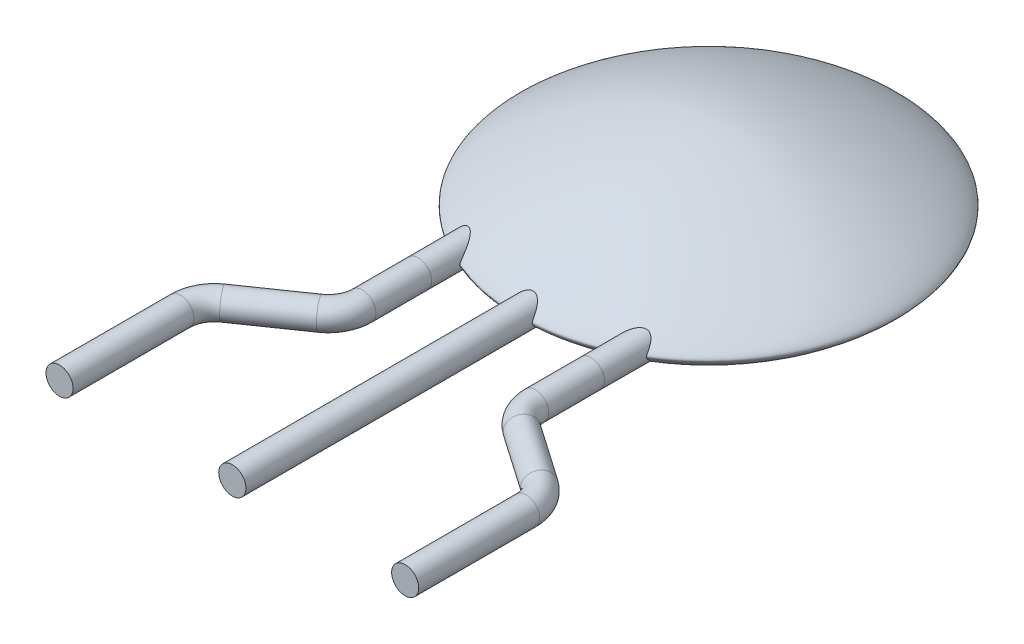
ISO-10303-21;
HEADER;
FILE_DESCRIPTION(('STEP AP214'),'2;1');
FILE_NAME('part.step','',(''),(''),'','','');
FILE_SCHEMA(('AUTOMOTIVE_DESIGN { 1 0 10303 214 1 1 1 1 }'));
ENDSEC;
DATA;
#1=APPLICATION_CONTEXT('core data for automotive mechanical design processes');
#2=APPLICATION_PROTOCOL_DEFINITION('international standard','automotive_design',2000,#1);
#3=PRODUCT_CONTEXT('',#1,'mechanical');
#4=PRODUCT('Part','Part','',(#3));
#5=PRODUCT_RELATED_PRODUCT_CATEGORY('part','',(#4));
#6=PRODUCT_DEFINITION_FORMATION('','',#4);
#7=PRODUCT_DEFINITION_CONTEXT('part definition',#1,'design');
#8=PRODUCT_DEFINITION('design','',#6,#7);
#9=PRODUCT_DEFINITION_SHAPE('','',#8);
#10=(LENGTH_UNIT() NAMED_UNIT(*) SI_UNIT(.MILLI.,.METRE.));
#11=(NAMED_UNIT(*) PLANE_ANGLE_UNIT() SI_UNIT($,.RADIAN.));
#12=(NAMED_UNIT(*) SI_UNIT($,.STERADIAN.) SOLID_ANGLE_UNIT());
#13=UNCERTAINTY_MEASURE_WITH_UNIT(LENGTH_MEASURE(1.E-05),#10,'distance_accuracy_value','');
#14=(GEOMETRIC_REPRESENTATION_CONTEXT(3) GLOBAL_UNCERTAINTY_ASSIGNED_CONTEXT((#13)) GLOBAL_UNIT_ASSIGNED_CONTEXT((#10,
#11,#12)) REPRESENTATION_CONTEXT('',''));
#15=CARTESIAN_POINT('',(0.,0.,0.));
#16=DIRECTION('',(0.,0.,1.));
#17=DIRECTION('',(1.,0.,0.));
#18=AXIS2_PLACEMENT_3D('',#15,#16,#17);
#19=CARTESIAN_POINT('',(0.,1.05,0.));
#20=CARTESIAN_POINT('',(-1.17248497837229,1.04999999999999,0.));
#21=CARTESIAN_POINT('',(-2.8,0.16193282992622,0.));
#22=CARTESIAN_POINT('',(-2.8,-0.16193282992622,0.));
#23=CARTESIAN_POINT('',(-1.2956675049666,-1.05,0.));
#24=CARTESIAN_POINT('',(0.,-1.05,0.));
#25=B_SPLINE_CURVE_WITH_KNOTS('',3,(#19,#20,#21,#22,#23,#24),.UNSPECIFIED.,.F.,.F.,(4,2,4),(0.,
0.5,1.),.UNSPECIFIED.);
#26=CARTESIAN_POINT('',(0.,1.05,0.));
#27=DIRECTION('',(0.,1.,0.));
#28=AXIS1_PLACEMENT('',#26,#27);
#29=SURFACE_OF_REVOLUTION('',#25,#28);
#30=CARTESIAN_POINT('',(0.,1.05,0.));
#31=VERTEX_POINT('',#30);
#32=VERTEX_LOOP('',#31);
#33=FACE_BOUND('',#32,.T.);
#34=CARTESIAN_POINT('',(0.,-1.05,0.));
#35=VERTEX_POINT('',#34);
#36=VERTEX_LOOP('',#35);
#37=FACE_BOUND('',#36,.T.);
#38=CARTESIAN_POINT('',(-1.07000000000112,0.,2.58748913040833));
#39=CARTESIAN_POINT('',(-1.07000007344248,0.0035103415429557,2.5874711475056));
#40=CARTESIAN_POINT('',(-1.0700971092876,0.00702169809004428,2.58662128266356));
#41=CARTESIAN_POINT('',(-1.07041537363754,0.0132211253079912,2.58427957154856));
#42=CARTESIAN_POINT('',(-1.07061950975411,0.0159572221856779,2.58288155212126));
#43=CARTESIAN_POINT('',(-1.07111315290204,0.0212332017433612,2.57975653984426));
#44=CARTESIAN_POINT('',(-1.07140274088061,0.0237728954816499,2.5780292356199));
#45=CARTESIAN_POINT('',(-1.07226853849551,0.0303236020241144,2.57315774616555));
#46=CARTESIAN_POINT('',(-1.07290725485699,0.0341892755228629,2.56983549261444));
#47=CARTESIAN_POINT('',(-1.07434210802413,0.0416192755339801,2.56289663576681));
#48=CARTESIAN_POINT('',(-1.07513856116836,0.0451829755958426,2.55927944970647));
#49=CARTESIAN_POINT('',(-1.07773991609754,0.0555649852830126,2.54812605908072));
#50=CARTESIAN_POINT('',(-1.07975131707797,0.0620379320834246,2.54031912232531));
#51=CARTESIAN_POINT('',(-1.08525949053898,0.0772174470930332,2.52073450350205));
#52=CARTESIAN_POINT('',(-1.08901458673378,0.0855886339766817,2.50877634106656));
#53=CARTESIAN_POINT('',(-1.09740659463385,0.101446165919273,2.48456948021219));
#54=CARTESIAN_POINT('',(-1.1020450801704,0.108930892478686,2.47232029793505));
#55=CARTESIAN_POINT('',(-1.11722017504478,0.130250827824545,2.4354907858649));
#56=CARTESIAN_POINT('',(-1.12903259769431,0.142993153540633,2.41077014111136));
#57=CARTESIAN_POINT('',(-1.15111463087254,0.161189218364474,2.3716400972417));
#58=CARTESIAN_POINT('',(-1.16019345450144,0.167548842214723,2.35696443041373));
#59=CARTESIAN_POINT('',(-1.1800307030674,0.178990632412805,2.32826965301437));
#60=CARTESIAN_POINT('',(-1.19078525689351,0.184075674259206,2.31424912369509));
#61=CARTESIAN_POINT('',(-1.20970824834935,0.190843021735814,2.29283846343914));
#62=CARTESIAN_POINT('',(-1.21719947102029,0.193073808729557,2.28503256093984));
#63=CARTESIAN_POINT('',(-1.23305361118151,0.196728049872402,2.27017658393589));
#64=CARTESIAN_POINT('',(-1.24141557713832,0.19815237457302,2.2631257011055));
#65=CARTESIAN_POINT('',(-1.26267378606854,0.200246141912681,2.24767217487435));
#66=CARTESIAN_POINT('',(-1.27607419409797,0.200411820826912,2.23979865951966));
#67=CARTESIAN_POINT('',(-1.29575451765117,0.198413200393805,2.23197621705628));
#68=CARTESIAN_POINT('',(-1.30141339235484,0.197603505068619,2.23011909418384));
#69=CARTESIAN_POINT('',(-1.31283467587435,0.195445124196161,2.22724673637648));
#70=CARTESIAN_POINT('',(-1.3185968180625,0.194097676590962,2.22622958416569));
#71=CARTESIAN_POINT('',(-1.33008757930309,0.190853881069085,2.22512623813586));
#72=CARTESIAN_POINT('',(-1.33581591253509,0.188954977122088,2.22504445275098));
#73=CARTESIAN_POINT('',(-1.34702183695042,0.184672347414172,2.22581464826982));
#74=CARTESIAN_POINT('',(-1.35249926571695,0.182288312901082,2.22666722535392));
#75=CARTESIAN_POINT('',(-1.37002044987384,0.1737242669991,2.23089411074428));
#76=CARTESIAN_POINT('',(-1.38120637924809,0.166681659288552,2.23611093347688));
#77=CARTESIAN_POINT('',(-1.39868029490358,0.15341313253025,2.24759147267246));
#78=CARTESIAN_POINT('',(-1.40550348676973,0.147367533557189,2.25334470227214));
#79=CARTESIAN_POINT('',(-1.41791099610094,0.134902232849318,2.26577636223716));
#80=CARTESIAN_POINT('',(-1.42349014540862,0.128481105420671,2.27245847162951));
#81=CARTESIAN_POINT('',(-1.43761563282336,0.110135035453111,2.29190207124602));
#82=CARTESIAN_POINT('',(-1.44496408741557,0.0979173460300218,2.30524975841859));
#83=CARTESIAN_POINT('',(-1.45393400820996,0.0788432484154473,2.32535242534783));
#84=CARTESIAN_POINT('',(-1.45658005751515,0.0723681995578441,2.3320593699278));
#85=CARTESIAN_POINT('',(-1.46122101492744,0.0590332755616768,2.3453124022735));
#86=CARTESIAN_POINT('',(-1.46321698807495,0.0521740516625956,2.35185873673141));
#87=CARTESIAN_POINT('',(-1.46549465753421,0.0422994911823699,2.36042809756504));
#88=CARTESIAN_POINT('',(-1.4660657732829,0.0395751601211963,2.36271014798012));
#89=CARTESIAN_POINT('',(-1.4671106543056,0.0339931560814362,2.36714635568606));
#90=CARTESIAN_POINT('',(-1.46758417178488,0.0311351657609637,2.36930017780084));
#91=CARTESIAN_POINT('',(-1.46842632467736,0.025218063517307,2.37340341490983));
#92=CARTESIAN_POINT('',(-1.46879397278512,0.0221573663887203,2.37535080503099));
#93=CARTESIAN_POINT('',(-1.46939989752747,0.0158115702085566,2.3788471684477));
#94=CARTESIAN_POINT('',(-1.46963868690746,0.012527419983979,2.38039770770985));
#95=CARTESIAN_POINT('',(-1.469931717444,0.00601419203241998,2.38247631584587));
#96=CARTESIAN_POINT('',(-1.47000501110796,0.00282782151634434,2.38310651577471));
#97=CARTESIAN_POINT('',(-1.46999436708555,-0.00353345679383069,2.38306083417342));
#98=CARTESIAN_POINT('',(-1.46991006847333,-0.00670832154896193,2.38238195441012));
#99=CARTESIAN_POINT('',(-1.46956313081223,-0.0138448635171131,2.38012817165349));
#100=CARTESIAN_POINT('',(-1.46925001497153,-0.0177116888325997,2.37832858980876));
#101=CARTESIAN_POINT('',(-1.46844336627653,-0.0251832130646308,2.37425653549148));
#102=CARTESIAN_POINT('',(-1.4679489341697,-0.0287864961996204,2.37198173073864));
#103=CARTESIAN_POINT('',(-1.46639794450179,-0.0382737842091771,2.36549642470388));
#104=CARTESIAN_POINT('',(-1.46519107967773,-0.0439696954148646,2.36105420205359));
#105=CARTESIAN_POINT('',(-1.46236424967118,-0.0550296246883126,2.35189177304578));
#106=CARTESIAN_POINT('',(-1.46074350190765,-0.0603929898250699,2.34717105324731));
#107=CARTESIAN_POINT('',(-1.45526780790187,-0.0761632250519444,2.33284257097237));
#108=CARTESIAN_POINT('',(-1.45080312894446,-0.0862293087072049,2.32308526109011));
#109=CARTESIAN_POINT('',(-1.44008619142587,-0.105803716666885,2.30396115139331));
#110=CARTESIAN_POINT('',(-1.43383178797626,-0.115311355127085,2.29459483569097));
#111=CARTESIAN_POINT('',(-1.4192140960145,-0.133691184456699,2.27704162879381));
#112=CARTESIAN_POINT('',(-1.410864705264,-0.142567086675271,2.2688475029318));
#113=CARTESIAN_POINT('',(-1.39194139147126,-0.158985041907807,2.25512818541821));
#114=CARTESIAN_POINT('',(-1.38149964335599,-0.166571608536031,2.24948998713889));
#115=CARTESIAN_POINT('',(-1.36404222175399,-0.176641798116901,2.24386275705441));
#116=CARTESIAN_POINT('',(-1.35787575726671,-0.179797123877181,2.24245903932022));
#117=CARTESIAN_POINT('',(-1.34511579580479,-0.185488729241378,2.24081779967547));
#118=CARTESIAN_POINT('',(-1.33852288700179,-0.188025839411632,2.24057870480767));
#119=CARTESIAN_POINT('',(-1.32599435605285,-0.192100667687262,2.24127714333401));
#120=CARTESIAN_POINT('',(-1.32007765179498,-0.19372293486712,2.24207354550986));
#121=CARTESIAN_POINT('',(-1.30828988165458,-0.196393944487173,2.24453539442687));
#122=CARTESIAN_POINT('',(-1.30241892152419,-0.197441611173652,2.24620245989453));
#123=CARTESIAN_POINT('',(-1.28173036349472,-0.200220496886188,2.25350546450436));
#124=CARTESIAN_POINT('',(-1.26744793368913,-0.200412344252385,2.26124858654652));
#125=CARTESIAN_POINT('',(-1.24367210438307,-0.19855059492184,2.27745974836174));
#126=CARTESIAN_POINT('',(-1.23378903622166,-0.196930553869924,2.28548682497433));
#127=CARTESIAN_POINT('',(-1.21515593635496,-0.192567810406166,2.30252755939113));
#128=CARTESIAN_POINT('',(-1.20640842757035,-0.189822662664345,2.31154333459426));
#129=CARTESIAN_POINT('',(-1.18312391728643,-0.180872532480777,2.33781449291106));
#130=CARTESIAN_POINT('',(-1.16974665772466,-0.173679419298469,2.35574476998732));
#131=CARTESIAN_POINT('',(-1.14553449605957,-0.157230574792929,2.39241632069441));
#132=CARTESIAN_POINT('',(-1.13471256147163,-0.147964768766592,2.41116118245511));
#133=CARTESIAN_POINT('',(-1.11441541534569,-0.126617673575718,2.45059864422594));
#134=CARTESIAN_POINT('',(-1.10516153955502,-0.114353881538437,2.47130911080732));
#135=CARTESIAN_POINT('',(-1.09332884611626,-0.0940585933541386,2.50176087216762));
#136=CARTESIAN_POINT('',(-1.08973506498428,-0.0870050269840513,2.51177494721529));
#137=CARTESIAN_POINT('',(-1.08326526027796,-0.0720900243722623,2.53142049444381));
#138=CARTESIAN_POINT('',(-1.08038778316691,-0.0642302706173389,2.54105270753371));
#139=CARTESIAN_POINT('',(-1.0769994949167,-0.0525524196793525,2.5537225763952));
#140=CARTESIAN_POINT('',(-1.07612835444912,-0.0492540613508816,2.55714222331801));
#141=CARTESIAN_POINT('',(-1.07451779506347,-0.0424169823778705,2.56380074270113));
#142=CARTESIAN_POINT('',(-1.07377897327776,-0.038877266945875,2.56703875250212));
#143=CARTESIAN_POINT('',(-1.07245180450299,-0.0314491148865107,2.57323383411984));
#144=CARTESIAN_POINT('',(-1.07186542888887,-0.0275569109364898,2.57618694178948));
#145=CARTESIAN_POINT('',(-1.07089676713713,-0.0193698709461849,2.58148352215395));
#146=CARTESIAN_POINT('',(-1.07051327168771,-0.0150776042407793,2.58383056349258));
#147=CARTESIAN_POINT('',(-1.07009863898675,-0.00708540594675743,2.58667789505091));
#148=CARTESIAN_POINT('',(-1.06999992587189,-0.00354322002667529,2.58750728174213));
#149=CARTESIAN_POINT('',(-1.07000000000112,0.,2.58748913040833));
#150=B_SPLINE_CURVE_WITH_KNOTS('',3,(#38,#39,#40,#41,#42,#43,#44,#45,#46,#47,#48,#49,#50,#51,
#52,#53,#54,#55,#56,#57,#58,#59,#60,#61,#62,#63,#64,#65,#66,#67,#68,#69,#70,#71,#72,#73,#74,#75,
#76,#77,#78,#79,#80,#81,#82,#83,#84,#85,#86,#87,#88,#89,#90,#91,#92,#93,#94,#95,#96,#97,#98,#99,
#100,#101,#102,#103,#104,#105,#106,#107,#108,#109,#110,#111,#112,#113,#114,#115,#116,#117,#118,
#119,#120,#121,#122,#123,#124,#125,#126,#127,#128,#129,#130,#131,#132,#133,#134,#135,#136,#137,
#138,#139,#140,#141,#142,#143,#144,#145,#146,#147,#148,#149),.UNSPECIFIED.,.T.,.F.,(4,2,2,2,2,2,
2,2,2,2,2,2,2,2,2,2,2,2,2,2,2,2,2,2,2,2,2,2,2,2,2,2,2,2,2,2,2,2,2,2,2,2,2,2,2,2,2,2,2,2,2,2,2,2,
2,4),(0.,0.010546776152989,0.019771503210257,0.0290049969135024,0.0443819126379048,
0.0597899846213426,0.0907492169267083,0.135892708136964,0.181117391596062,0.271348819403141,
0.326439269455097,0.381404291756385,0.414466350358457,0.447492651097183,0.493269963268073,
0.511231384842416,0.529151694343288,0.54715642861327,0.565172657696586,0.606928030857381,
0.639155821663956,0.671515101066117,0.729767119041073,0.758828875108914,0.787842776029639,
0.798637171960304,0.809458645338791,0.820377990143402,0.831253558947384,0.840794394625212,
0.850357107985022,0.863138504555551,0.875984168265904,0.897909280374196,0.919876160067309,
0.963890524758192,1.00795786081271,1.05174025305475,1.09333245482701,1.11441723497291,
1.13547352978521,1.15393946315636,1.17243985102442,1.22019892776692,1.25857921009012,
1.29704335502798,1.36716149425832,1.43762816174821,1.51470036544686,1.55296795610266,
1.59115724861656,1.60564057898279,1.62018770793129,1.63491452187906,1.64955253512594,
1.66019809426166),.UNSPECIFIED.);
#151=CARTESIAN_POINT('',(-1.07000000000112,0.,2.58748913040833));
#152=VERTEX_POINT('',#151);
#153=EDGE_CURVE('E46',#152,#152,#150,.T.);
#154=ORIENTED_EDGE('',*,*,#153,.F.);
#155=EDGE_LOOP('',(#154));
#156=FACE_BOUND('',#155,.T.);
#157=CARTESIAN_POINT('',(1.47000000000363,0.,2.38308623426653));
#158=CARTESIAN_POINT('',(1.46999967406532,0.00371449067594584,2.3830677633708));
#159=CARTESIAN_POINT('',(1.46989144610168,0.007420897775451,2.38215189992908));
#160=CARTESIAN_POINT('',(1.46947322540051,0.0151314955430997,2.3792964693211));
#161=CARTESIAN_POINT('',(1.4691278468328,0.0190516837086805,2.37719144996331));
#162=CARTESIAN_POINT('',(1.46825798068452,0.0266046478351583,2.37252553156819));
#163=CARTESIAN_POINT('',(1.46773279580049,0.0302362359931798,2.36996287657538));
#164=CARTESIAN_POINT('',(1.46605837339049,0.0400254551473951,2.36251611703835));
#165=CARTESIAN_POINT('',(1.46474134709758,0.0459528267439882,2.35737566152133));
#166=CARTESIAN_POINT('',(1.46166454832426,0.0574419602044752,2.34682128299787));
#167=CARTESIAN_POINT('',(1.45990392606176,0.0630029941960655,2.34140685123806));
#168=CARTESIAN_POINT('',(1.45395505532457,0.0793507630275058,2.32499898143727));
#169=CARTESIAN_POINT('',(1.44910577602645,0.0897700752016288,2.31386955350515));
#170=CARTESIAN_POINT('',(1.43739431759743,0.110074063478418,2.29206232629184));
#171=CARTESIAN_POINT('',(1.43052219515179,0.119955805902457,2.28138706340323));
#172=CARTESIAN_POINT('',(1.41430596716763,0.139041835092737,2.2615025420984));
#173=CARTESIAN_POINT('',(1.40498460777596,0.148251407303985,2.25228098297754));
#174=CARTESIAN_POINT('',(1.38506181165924,0.163974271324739,2.23832270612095));
#175=CARTESIAN_POINT('',(1.37501084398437,0.170671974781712,2.23307313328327));
#176=CARTESIAN_POINT('',(1.35835411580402,0.179538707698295,2.22790199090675));
#177=CARTESIAN_POINT('',(1.35249504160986,0.182311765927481,2.2266295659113));
#178=CARTESIAN_POINT('',(1.34041669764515,0.187306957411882,2.22518087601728));
#179=CARTESIAN_POINT('',(1.33419785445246,0.189529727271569,2.22500333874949));
#180=CARTESIAN_POINT('',(1.32233866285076,0.193118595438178,2.2257422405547));
#181=CARTESIAN_POINT('',(1.31671079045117,0.194552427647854,2.22653934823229));
#182=CARTESIAN_POINT('',(1.30551924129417,0.196904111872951,2.22895871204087));
#183=CARTESIAN_POINT('',(1.29995570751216,0.197820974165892,2.23058253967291));
#184=CARTESIAN_POINT('',(1.28005556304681,0.200274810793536,2.23777048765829));
#185=CARTESIAN_POINT('',(1.26629751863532,0.200362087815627,2.24542884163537));
#186=CARTESIAN_POINT('',(1.24324630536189,0.19848203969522,2.26155224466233));
#187=CARTESIAN_POINT('',(1.23359562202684,0.196883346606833,2.26962107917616));
#188=CARTESIAN_POINT('',(1.21542939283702,0.192633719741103,2.2867414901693));
#189=CARTESIAN_POINT('',(1.20691674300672,0.189980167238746,2.29579547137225));
#190=CARTESIAN_POINT('',(1.18374390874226,0.181178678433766,2.3227804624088));
#191=CARTESIAN_POINT('',(1.17034619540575,0.174021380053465,2.34144767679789));
#192=CARTESIAN_POINT('',(1.14616991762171,0.157723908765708,2.37960538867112));
#193=CARTESIAN_POINT('',(1.13540091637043,0.148576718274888,2.39909859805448));
#194=CARTESIAN_POINT('',(1.11509610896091,0.127449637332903,2.44037694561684));
#195=CARTESIAN_POINT('',(1.10581030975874,0.115272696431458,2.46218689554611));
#196=CARTESIAN_POINT('',(1.09389818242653,0.0951199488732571,2.49440971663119));
#197=CARTESIAN_POINT('',(1.09026576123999,0.0880944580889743,2.50505995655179));
#198=CARTESIAN_POINT('',(1.08371435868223,0.0732419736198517,2.52600950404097));
#199=CARTESIAN_POINT('',(1.08079413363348,0.0654164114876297,2.53630939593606));
#200=CARTESIAN_POINT('',(1.07695482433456,0.0524892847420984,2.55144772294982));
#201=CARTESIAN_POINT('',(1.07573914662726,0.047829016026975,2.5565842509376));
#202=CARTESIAN_POINT('',(1.07358552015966,0.0380358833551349,2.56641055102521));
#203=CARTESIAN_POINT('',(1.07264620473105,0.0329055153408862,2.57110244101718));
#204=CARTESIAN_POINT('',(1.07134379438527,0.0234759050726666,2.57832353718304));
#205=CARTESIAN_POINT('',(1.07089242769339,0.0193812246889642,2.58108151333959));
#206=CARTESIAN_POINT('',(1.07043460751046,0.013287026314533,2.5841588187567));
#207=CARTESIAN_POINT('',(1.07032479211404,0.011535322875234,2.58493876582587));
#208=CARTESIAN_POINT('',(1.07014974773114,0.00794304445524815,2.58624351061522));
#209=CARTESIAN_POINT('',(1.07008425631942,0.00610306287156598,2.58676980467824));
#210=CARTESIAN_POINT('',(1.07001359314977,0.00275389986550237,2.58735975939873));
#211=CARTESIAN_POINT('',(1.0699984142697,0.00125960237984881,2.58749904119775));
#212=CARTESIAN_POINT('',(1.07000185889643,-0.0017270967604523,2.58747686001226));
#213=CARTESIAN_POINT('',(1.07002052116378,-0.00321949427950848,2.58731505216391));
#214=CARTESIAN_POINT('',(1.07010547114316,-0.00684279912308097,2.58665719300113));
#215=CARTESIAN_POINT('',(1.07018981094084,-0.00894936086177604,2.58604106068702));
#216=CARTESIAN_POINT('',(1.07041594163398,-0.0130559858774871,2.58451471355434));
#217=CARTESIAN_POINT('',(1.0705580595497,-0.0150553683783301,2.58360283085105));
#218=CARTESIAN_POINT('',(1.07118369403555,-0.0223954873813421,2.57982222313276));
#219=CARTESIAN_POINT('',(1.07182673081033,-0.0273977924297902,2.57634290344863));
#220=CARTESIAN_POINT('',(1.07337429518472,-0.0368965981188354,2.56882704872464));
#221=CARTESIAN_POINT('',(1.07427990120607,-0.0413909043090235,2.56478825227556));
#222=CARTESIAN_POINT('',(1.07689696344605,-0.0525418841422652,2.55395847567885));
#223=CARTESIAN_POINT('',(1.07877067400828,-0.0589347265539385,2.54693376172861));
#224=CARTESIAN_POINT('',(1.08296877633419,-0.0711381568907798,2.53251689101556));
#225=CARTESIAN_POINT('',(1.08529412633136,-0.0769474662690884,2.52512397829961));
#226=CARTESIAN_POINT('',(1.09289308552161,-0.0937284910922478,2.50260626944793));
#227=CARTESIAN_POINT('',(1.09878018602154,-0.104017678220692,2.48718145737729));
#228=CARTESIAN_POINT('',(1.11571571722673,-0.128553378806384,2.44757864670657));
#229=CARTESIAN_POINT('',(1.1278210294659,-0.141858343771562,2.42325865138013));
#230=CARTESIAN_POINT('',(1.14889420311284,-0.159420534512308,2.38744991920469));
#231=CARTESIAN_POINT('',(1.15638184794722,-0.164864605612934,2.37565457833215));
#232=CARTESIAN_POINT('',(1.17246484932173,-0.174862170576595,2.3524579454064));
#233=CARTESIAN_POINT('',(1.18105958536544,-0.179416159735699,2.34105643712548));
#234=CARTESIAN_POINT('',(1.20245860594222,-0.188719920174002,2.31542838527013));
#235=CARTESIAN_POINT('',(1.21573949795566,-0.193087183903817,2.30143076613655));
#236=CARTESIAN_POINT('',(1.23785298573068,-0.197541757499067,2.28227030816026));
#237=CARTESIAN_POINT('',(1.24563867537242,-0.198677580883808,2.27616094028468));
#238=CARTESIAN_POINT('',(1.2619611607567,-0.200008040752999,2.26495020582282));
#239=CARTESIAN_POINT('',(1.27049599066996,-0.200205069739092,2.25984630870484));
#240=CARTESIAN_POINT('',(1.29106674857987,-0.199220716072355,2.24981534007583));
#241=CARTESIAN_POINT('',(1.30337730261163,-0.19760124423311,2.24541555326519));
#242=CARTESIAN_POINT('',(1.32200782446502,-0.193228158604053,2.24175942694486));
#243=CARTESIAN_POINT('',(1.32827702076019,-0.191432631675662,2.24103517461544));
#244=CARTESIAN_POINT('',(1.34064007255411,-0.187223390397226,2.24063623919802));
#245=CARTESIAN_POINT('',(1.34673393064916,-0.184809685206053,2.24096154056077));
#246=CARTESIAN_POINT('',(1.36333291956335,-0.177272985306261,2.24329652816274));
#247=CARTESIAN_POINT('',(1.37340387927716,-0.171541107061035,2.24645906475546));
#248=CARTESIAN_POINT('',(1.39679225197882,-0.155646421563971,2.25743180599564));
#249=CARTESIAN_POINT('',(1.4088013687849,-0.1447919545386,2.26684846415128));
#250=CARTESIAN_POINT('',(1.42758368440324,-0.12383576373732,2.28631127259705));
#251=CARTESIAN_POINT('',(1.43486726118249,-0.113858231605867,2.29606099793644));
#252=CARTESIAN_POINT('',(1.44731853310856,-0.0932863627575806,2.31620778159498));
#253=CARTESIAN_POINT('',(1.45248991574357,-0.0826931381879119,2.32660367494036));
#254=CARTESIAN_POINT('',(1.4584793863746,-0.0670758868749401,2.34112770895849));
#255=CARTESIAN_POINT('',(1.46007249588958,-0.062426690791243,2.3453582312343));
#256=CARTESIAN_POINT('',(1.46294836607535,-0.052877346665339,2.35370298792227));
#257=CARTESIAN_POINT('',(1.46422918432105,-0.0479758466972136,2.35781636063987));
#258=CARTESIAN_POINT('',(1.46647252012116,-0.037769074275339,2.3657990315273));
#259=CARTESIAN_POINT('',(1.46742991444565,-0.0324588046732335,2.36966368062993));
#260=CARTESIAN_POINT('',(1.46856250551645,-0.0240956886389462,2.37484731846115));
#261=CARTESIAN_POINT('',(1.46888858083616,-0.0212566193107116,2.37646649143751));
#262=CARTESIAN_POINT('',(1.46942805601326,-0.0154020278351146,2.37935633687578));
#263=CARTESIAN_POINT('',(1.46964161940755,-0.0123867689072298,2.38062751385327));
#264=CARTESIAN_POINT('',(1.46992461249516,-0.00623777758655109,2.38248569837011));
#265=CARTESIAN_POINT('',(1.47000027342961,-0.00311604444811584,2.3831017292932));
#266=CARTESIAN_POINT('',(1.47000000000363,0.,2.38308623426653));
#267=B_SPLINE_CURVE_WITH_KNOTS('',3,(#157,#158,#159,#160,#161,#162,#163,#164,#165,#166,#167,
#168,#169,#170,#171,#172,#173,#174,#175,#176,#177,#178,#179,#180,#181,#182,#183,#184,#185,#186,
#187,#188,#189,#190,#191,#192,#193,#194,#195,#196,#197,#198,#199,#200,#201,#202,#203,#204,#205,
#206,#207,#208,#209,#210,#211,#212,#213,#214,#215,#216,#217,#218,#219,#220,#221,#222,#223,#224,
#225,#226,#227,#228,#229,#230,#231,#232,#233,#234,#235,#236,#237,#238,#239,#240,#241,#242,#243,
#244,#245,#246,#247,#248,#249,#250,#251,#252,#253,#254,#255,#256,#257,#258,#259,#260,#261,#262,
#263,#264,#265,#266),.UNSPECIFIED.,.T.,.F.,(4,2,2,2,2,2,2,2,2,2,2,2,2,2,2,2,2,2,2,2,2,2,2,2,2,2,
2,2,2,2,2,2,2,2,2,2,2,2,2,2,2,2,2,2,2,2,2,2,2,2,2,2,2,2,4),(0.,0.0111621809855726,
0.0245119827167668,0.0379141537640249,0.0617319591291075,0.0855957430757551,0.13345252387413,
0.181548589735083,0.22921287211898,0.268113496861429,0.287822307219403,0.307508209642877,
0.325007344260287,0.342539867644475,0.388830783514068,0.426752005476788,0.464767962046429,
0.536579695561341,0.608648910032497,0.688322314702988,0.728092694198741,0.767793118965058,
0.788895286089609,0.809891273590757,0.824662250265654,0.830411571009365,0.836126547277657,
0.840601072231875,0.845080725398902,0.851634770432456,0.858226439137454,0.876465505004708,
0.894780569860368,0.92375500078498,0.952791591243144,1.01102420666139,1.1013290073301,
1.14625445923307,1.19115484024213,1.25006902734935,1.27985687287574,1.3095687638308,
1.34832979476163,1.36790587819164,1.38748167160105,1.42294649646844,1.47812988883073,
1.52519474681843,1.57217708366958,1.59162290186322,1.61118675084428,1.63104737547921,
1.64088142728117,1.65070114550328,1.66006497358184),.UNSPECIFIED.);
#268=CARTESIAN_POINT('',(1.47000000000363,0.,2.38308623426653));
#269=VERTEX_POINT('',#268);
#270=EDGE_CURVE('E11',#269,#269,#267,.T.);
#271=ORIENTED_EDGE('',*,*,#270,.F.);
#272=EDGE_LOOP('',(#271));
#273=FACE_BOUND('',#272,.T.);
#274=CARTESIAN_POINT('',(-0.2,0.,2.79284800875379));
#275=CARTESIAN_POINT('',(-0.199999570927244,0.00445009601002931,2.79282978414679));
#276=CARTESIAN_POINT('',(-0.199843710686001,0.00888924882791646,2.79165131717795));
#277=CARTESIAN_POINT('',(-0.199264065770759,0.0178238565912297,2.7881593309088));
#278=CARTESIAN_POINT('',(-0.198806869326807,0.0222455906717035,2.7857137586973));
#279=CARTESIAN_POINT('',(-0.197666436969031,0.0307535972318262,2.78031101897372));
#280=CARTESIAN_POINT('',(-0.196982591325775,0.0348389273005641,2.77735248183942));
#281=CARTESIAN_POINT('',(-0.194944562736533,0.0451584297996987,2.76927184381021));
#282=CARTESIAN_POINT('',(-0.193435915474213,0.0511835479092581,2.76393068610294));
#283=CARTESIAN_POINT('',(-0.189977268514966,0.062809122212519,2.75293271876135));
#284=CARTESIAN_POINT('',(-0.188026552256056,0.0684088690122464,2.74727540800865));
#285=CARTESIAN_POINT('',(-0.181539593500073,0.0847457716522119,2.73005869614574));
#286=CARTESIAN_POINT('',(-0.176373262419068,0.0949988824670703,2.71827390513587));
#287=CARTESIAN_POINT('',(-0.163715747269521,0.115573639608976,2.69354952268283));
#288=CARTESIAN_POINT('',(-0.156037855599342,0.125790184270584,2.68061813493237));
#289=CARTESIAN_POINT('',(-0.138361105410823,0.145003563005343,2.65553250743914));
#290=CARTESIAN_POINT('',(-0.128372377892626,0.154005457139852,2.64337516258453));
#291=CARTESIAN_POINT('',(-0.105201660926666,0.17071503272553,2.62034820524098));
#292=CARTESIAN_POINT('',(-0.0919371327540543,0.178378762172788,2.60952489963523));
#293=CARTESIAN_POINT('',(-0.0639703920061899,0.189995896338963,2.59292646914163));
#294=CARTESIAN_POINT('',(-0.0497674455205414,0.194329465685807,2.58664269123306));
#295=CARTESIAN_POINT('',(-0.0221325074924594,0.199166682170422,2.57961019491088));
#296=CARTESIAN_POINT('',(-0.00902135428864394,0.200219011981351,2.57806918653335));
#297=CARTESIAN_POINT('',(0.0170258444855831,0.199700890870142,2.57882543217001));
#298=CARTESIAN_POINT('',(0.0299618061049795,0.198129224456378,2.58112446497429));
#299=CARTESIAN_POINT('',(0.0579248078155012,0.192115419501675,2.58984985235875));
#300=CARTESIAN_POINT('',(0.0724522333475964,0.18696653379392,2.59728903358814));
#301=CARTESIAN_POINT('',(0.095488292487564,0.176084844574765,2.61274872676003));
#302=CARTESIAN_POINT('',(0.104611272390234,0.17076501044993,2.62023346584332));
#303=CARTESIAN_POINT('',(0.121402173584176,0.159262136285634,2.63615938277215));
#304=CARTESIAN_POINT('',(0.129065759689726,0.15307661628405,2.6446032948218));
#305=CARTESIAN_POINT('',(0.147555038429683,0.135920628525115,2.66755381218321));
#306=CARTESIAN_POINT('',(0.157307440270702,0.124401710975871,2.68251175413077));
#307=CARTESIAN_POINT('',(0.169772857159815,0.10597831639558,2.70514798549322));
#308=CARTESIAN_POINT('',(0.173569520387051,0.0996411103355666,2.71273243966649));
#309=CARTESIAN_POINT('',(0.180464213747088,0.0865311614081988,2.72783187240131));
#310=CARTESIAN_POINT('',(0.183562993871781,0.0797588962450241,2.73534691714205));
#311=CARTESIAN_POINT('',(0.189098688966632,0.0655796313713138,2.75021804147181));
#312=CARTESIAN_POINT('',(0.191527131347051,0.0581659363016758,2.75757109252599));
#313=CARTESIAN_POINT('',(0.19458719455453,0.0463917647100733,2.76807253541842));
#314=CARTESIAN_POINT('',(0.195511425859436,0.0423490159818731,2.77149154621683));
#315=CARTESIAN_POINT('',(0.197139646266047,0.0339735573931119,2.77800739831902));
#316=CARTESIAN_POINT('',(0.19784420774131,0.0296416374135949,2.78110506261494));
#317=CARTESIAN_POINT('',(0.198811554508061,0.0219946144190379,2.78578348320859));
#318=CARTESIAN_POINT('',(0.199143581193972,0.0187928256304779,2.78753373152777));
#319=CARTESIAN_POINT('',(0.199656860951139,0.0121621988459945,2.7904827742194));
#320=CARTESIAN_POINT('',(0.199840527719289,0.00873801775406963,2.79169024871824));
#321=CARTESIAN_POINT('',(0.199976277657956,0.00350962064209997,2.79265346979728));
#322=CARTESIAN_POINT('',(0.199999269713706,0.00179621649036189,2.79283832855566));
#323=CARTESIAN_POINT('',(0.200000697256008,-0.00163362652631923,2.79285742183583));
#324=CARTESIAN_POINT('',(0.199979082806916,-0.00335006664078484,2.79269126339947));
#325=CARTESIAN_POINT('',(0.199871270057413,-0.0076272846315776,2.79197337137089));
#326=CARTESIAN_POINT('',(0.199757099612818,-0.0101577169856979,2.79126489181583));
#327=CARTESIAN_POINT('',(0.199444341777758,-0.0151050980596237,2.7895117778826));
#328=CARTESIAN_POINT('',(0.199245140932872,-0.0175210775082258,2.78846471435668));
#329=CARTESIAN_POINT('',(0.198655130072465,-0.02342776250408,2.78558074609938));
#330=CARTESIAN_POINT('',(0.198218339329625,-0.0268479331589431,2.78361144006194));
#331=CARTESIAN_POINT('',(0.197203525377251,-0.0334973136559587,2.77940137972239));
#332=CARTESIAN_POINT('',(0.196625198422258,-0.0367260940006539,2.77716004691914));
#333=CARTESIAN_POINT('',(0.194699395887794,-0.0461932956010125,2.77018006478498));
#334=CARTESIAN_POINT('',(0.193161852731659,-0.0522058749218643,2.7651892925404));
#335=CARTESIAN_POINT('',(0.189435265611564,-0.0644985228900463,2.75430804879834));
#336=CARTESIAN_POINT('',(0.187191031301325,-0.0707275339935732,2.74838064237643));
#337=CARTESIAN_POINT('',(0.182171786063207,-0.0828013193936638,2.73635182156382));
#338=CARTESIAN_POINT('',(0.179396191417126,-0.0886456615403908,2.73025022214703));
#339=CARTESIAN_POINT('',(0.170286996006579,-0.10568395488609,2.71188815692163));
#340=CARTESIAN_POINT('',(0.163166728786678,-0.116396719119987,2.69955751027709));
#341=CARTESIAN_POINT('',(0.148186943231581,-0.134731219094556,2.67767181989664));
#342=CARTESIAN_POINT('',(0.14071098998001,-0.142557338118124,2.66802696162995));
#343=CARTESIAN_POINT('',(0.124085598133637,-0.15724720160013,2.64953143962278));
#344=CARTESIAN_POINT('',(0.114940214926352,-0.164113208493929,2.64067892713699));
#345=CARTESIAN_POINT('',(0.0917967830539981,-0.178333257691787,2.62206959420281));
#346=CARTESIAN_POINT('',(0.0771558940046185,-0.185301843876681,2.61273407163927));
#347=CARTESIAN_POINT('',(0.054465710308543,-0.192560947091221,2.60292368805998));
#348=CARTESIAN_POINT('',(0.0477373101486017,-0.194348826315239,2.60049431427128));
#349=CARTESIAN_POINT('',(0.0338820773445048,-0.197235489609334,2.59656237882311));
#350=CARTESIAN_POINT('',(0.0267562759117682,-0.198335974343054,2.5950575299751));
#351=CARTESIAN_POINT('',(0.0122275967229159,-0.199759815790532,2.59310919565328));
#352=CARTESIAN_POINT('',(0.0048231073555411,-0.200077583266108,2.59267334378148));
#353=CARTESIAN_POINT('',(-0.00995284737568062,-0.199889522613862,2.59293089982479));
#354=CARTESIAN_POINT('',(-0.0173243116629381,-0.199383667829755,2.59362434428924));
#355=CARTESIAN_POINT('',(-0.0376273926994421,-0.196865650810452,2.59706793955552));
#356=CARTESIAN_POINT('',(-0.0502500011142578,-0.193967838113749,2.60102556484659));
#357=CARTESIAN_POINT('',(-0.0798391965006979,-0.184346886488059,2.61401950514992));
#358=CARTESIAN_POINT('',(-0.0956568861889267,-0.176418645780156,2.62462600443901));
#359=CARTESIAN_POINT('',(-0.120470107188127,-0.160183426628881,2.64576228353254));
#360=CARTESIAN_POINT('',(-0.130200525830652,-0.15230172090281,2.65584502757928));
#361=CARTESIAN_POINT('',(-0.147680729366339,-0.13541689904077,2.67683556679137));
#362=CARTESIAN_POINT('',(-0.155423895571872,-0.126410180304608,2.68774596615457));
#363=CARTESIAN_POINT('',(-0.16957072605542,-0.106783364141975,2.71057193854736));
#364=CARTESIAN_POINT('',(-0.175849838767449,-0.0960955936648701,2.72250587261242));
#365=CARTESIAN_POINT('',(-0.183794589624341,-0.0791076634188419,2.74009280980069));
#366=CARTESIAN_POINT('',(-0.186194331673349,-0.0732964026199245,2.7458931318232));
#367=CARTESIAN_POINT('',(-0.190492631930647,-0.0612655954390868,2.75724645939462));
#368=CARTESIAN_POINT('',(-0.192391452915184,-0.0550462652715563,2.7627995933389));
#369=CARTESIAN_POINT('',(-0.195753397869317,-0.0416171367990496,2.77375036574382));
#370=CARTESIAN_POINT('',(-0.197180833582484,-0.0343694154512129,2.77911527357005));
#371=CARTESIAN_POINT('',(-0.198908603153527,-0.0214913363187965,2.78669360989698));
#372=CARTESIAN_POINT('',(-0.199428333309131,-0.016176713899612,2.78935389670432));
#373=CARTESIAN_POINT('',(-0.199902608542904,-0.00707667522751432,2.79214487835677));
#374=CARTESIAN_POINT('',(-0.200000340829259,-0.00353488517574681,2.79286248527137));
#375=CARTESIAN_POINT('',(-0.2,0.,2.79284800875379));
#376=B_SPLINE_CURVE_WITH_KNOTS('',3,(#274,#275,#276,#277,#278,#279,#280,#281,#282,#283,#284,
#285,#286,#287,#288,#289,#290,#291,#292,#293,#294,#295,#296,#297,#298,#299,#300,#301,#302,#303,
#304,#305,#306,#307,#308,#309,#310,#311,#312,#313,#314,#315,#316,#317,#318,#319,#320,#321,#322,
#323,#324,#325,#326,#327,#328,#329,#330,#331,#332,#333,#334,#335,#336,#337,#338,#339,#340,#341,
#342,#343,#344,#345,#346,#347,#348,#349,#350,#351,#352,#353,#354,#355,#356,#357,#358,#359,#360,
#361,#362,#363,#364,#365,#366,#367,#368,#369,#370,#371,#372,#373,#374,#375),.UNSPECIFIED.,.T.,
.F.,(4,2,2,2,2,2,2,2,2,2,2,2,2,2,2,2,2,2,2,2,2,2,2,2,2,2,2,2,2,2,2,2,2,2,2,2,2,2,2,2,2,2,2,2,2,
2,2,2,2,2,4),(0.,0.013383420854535,0.028578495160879,0.0438147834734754,0.0683435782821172,
0.0929124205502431,0.142137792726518,0.196514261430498,0.250656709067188,0.306334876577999,
0.353814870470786,0.392754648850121,0.431712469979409,0.482097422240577,0.520786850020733,
0.559589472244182,0.622978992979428,0.654721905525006,0.686430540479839,0.718523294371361,
0.734636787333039,0.750707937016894,0.76168142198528,0.772472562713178,0.777612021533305,
0.782757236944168,0.790606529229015,0.798513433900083,0.810396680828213,0.822305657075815,
0.84614671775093,0.872778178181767,0.899439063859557,0.952703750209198,0.996065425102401,
1.03932313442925,1.09448229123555,1.11652018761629,1.13850334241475,1.16064302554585,
1.18278342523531,1.22277501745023,1.28353768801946,1.33160420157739,1.3798287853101,
1.4312853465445,1.45692598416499,1.4825531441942,1.50982142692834,1.52759358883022,
1.53822456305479),.UNSPECIFIED.);
#377=CARTESIAN_POINT('',(-0.2,0.,2.79284800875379));
#378=VERTEX_POINT('',#377);
#379=EDGE_CURVE('E38',#378,#378,#376,.T.);
#380=ORIENTED_EDGE('',*,*,#379,.T.);
#381=EDGE_LOOP('',(#380));
#382=FACE_BOUND('',#381,.T.);
#383=ADVANCED_FACE('F33',(#33,#37,#156,#273,#382),#29,.F.);
#384=CARTESIAN_POINT('',(-1.27,0.,-500000.));
#385=DIRECTION('',(0.,0.,1.));
#386=DIRECTION('',(1.,0.,0.));
#387=AXIS2_PLACEMENT_3D('',#384,#385,#386);
#388=CYLINDRICAL_SURFACE('',#387,0.2);
#389=ORIENTED_EDGE('',*,*,#153,.T.);
#390=EDGE_LOOP('',(#389));
#391=FACE_BOUND('',#390,.T.);
#392=CARTESIAN_POINT('',(-1.27,0.,3.));
#393=DIRECTION('',(0.,0.,1.));
#394=DIRECTION('',(1.,0.,0.));
#395=AXIS2_PLACEMENT_3D('',#392,#393,#394);
#396=CIRCLE('',#395,0.199);
#397=CARTESIAN_POINT('',(-1.071,0.,3.));
#398=VERTEX_POINT('',#397);
#399=EDGE_CURVE('E155',#398,#398,#396,.T.);
#400=ORIENTED_EDGE('',*,*,#399,.F.);
#401=EDGE_LOOP('',(#400));
#402=FACE_BOUND('',#401,.T.);
#403=ADVANCED_FACE('F55',(#391,#402),#388,.T.);
#404=CARTESIAN_POINT('',(1.27,0.,-500000.));
#405=DIRECTION('',(0.,0.,1.));
#406=DIRECTION('',(1.,0.,0.));
#407=AXIS2_PLACEMENT_3D('',#404,#405,#406);
#408=CYLINDRICAL_SURFACE('',#407,0.2);
#409=ORIENTED_EDGE('',*,*,#270,.T.);
#410=EDGE_LOOP('',(#409));
#411=FACE_BOUND('',#410,.T.);
#412=CARTESIAN_POINT('',(1.27,0.,3.));
#413=DIRECTION('',(0.,0.,1.));
#414=DIRECTION('',(-1.,0.,0.));
#415=AXIS2_PLACEMENT_3D('',#412,#413,#414);
#416=CIRCLE('',#415,0.199);
#417=CARTESIAN_POINT('',(1.071,0.,3.));
#418=VERTEX_POINT('',#417);
#419=EDGE_CURVE('E90',#418,#418,#416,.T.);
#420=ORIENTED_EDGE('',*,*,#419,.F.);
#421=EDGE_LOOP('',(#420));
#422=FACE_BOUND('',#421,.T.);
#423=ADVANCED_FACE('F162',(#411,#422),#408,.T.);
#424=CARTESIAN_POINT('',(-2.54,0.,5.22237451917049));
#425=DIRECTION('',(0.,0.,1.));
#426=DIRECTION('',(1.,0.,0.));
#427=AXIS2_PLACEMENT_3D('',#424,#425,#426);
#428=CYLINDRICAL_SURFACE('',#427,0.199);
#429=CARTESIAN_POINT('',(-2.54,0.,5.22237451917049));
#430=DIRECTION('',(0.,0.,1.));
#431=DIRECTION('',(1.,0.,0.));
#432=AXIS2_PLACEMENT_3D('',#429,#430,#431);
#433=CIRCLE('',#432,0.199);
#434=CARTESIAN_POINT('',(-2.739,0.,5.22237451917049));
#435=VERTEX_POINT('',#434);
#436=EDGE_CURVE('E187',#435,#435,#433,.T.);
#437=ORIENTED_EDGE('',*,*,#436,.T.);
#438=EDGE_LOOP('',(#437));
#439=FACE_BOUND('',#438,.T.);
#440=CARTESIAN_POINT('',(-2.54,0.,7.));
#441=DIRECTION('',(0.,0.,1.));
#442=DIRECTION('',(1.,0.,0.));
#443=AXIS2_PLACEMENT_3D('',#440,#441,#442);
#444=CIRCLE('',#443,0.199);
#445=CARTESIAN_POINT('',(-2.341,0.,7.));
#446=VERTEX_POINT('',#445);
#447=EDGE_CURVE('E185',#446,#446,#444,.T.);
#448=ORIENTED_EDGE('',*,*,#447,.F.);
#449=EDGE_LOOP('',(#448));
#450=FACE_BOUND('',#449,.T.);
#451=ADVANCED_FACE('F213',(#439,#450),#428,.T.);
#452=CARTESIAN_POINT('',(-2.04,0.,5.22237451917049));
#453=DIRECTION('',(0.,1.,0.));
#454=DIRECTION('',(0.,0.,1.));
#455=AXIS2_PLACEMENT_3D('',#452,#453,#454);
#456=TOROIDAL_SURFACE('',#455,0.500000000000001,0.199);
#457=CARTESIAN_POINT('',(-2.32486617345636,0.,4.81145936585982));
#458=DIRECTION('',(-0.821830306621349,0.,0.569732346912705));
#459=DIRECTION('',(0.569732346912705,0.,0.821830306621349));
#460=AXIS2_PLACEMENT_3D('',#457,#458,#459);
#461=CIRCLE('',#460,0.199);
#462=CARTESIAN_POINT('',(-2.43824291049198,0.,4.64791513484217));
#463=VERTEX_POINT('',#462);
#464=EDGE_CURVE('E190',#463,#463,#461,.T.);
#465=CARTESIAN_POINT('',(-2.04,0.,5.22237451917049));
#466=DIRECTION('',(0.,1.,0.));
#467=DIRECTION('',(0.,0.,1.));
#468=AXIS2_PLACEMENT_3D('',#465,#466,#467);
#469=CIRCLE('',#468,0.699000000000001);
#470=EDGE_CURVE('',#463,#435,#469,.T.);
#471=ORIENTED_EDGE('',*,*,#464,.T.);
#472=ORIENTED_EDGE('',*,*,#436,.F.);
#473=ORIENTED_EDGE('',*,*,#470,.T.);
#474=ORIENTED_EDGE('',*,*,#470,.F.);
#475=EDGE_LOOP('',(#471,#473,#472,#474));
#476=FACE_BOUND('',#475,.T.);
#477=ADVANCED_FACE('F209',(#476),#456,.T.);
#478=CARTESIAN_POINT('',(-1.48513382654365,0.,4.22931646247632));
#479=DIRECTION('',(-0.821830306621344,0.,0.569732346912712));
#480=DIRECTION('',(0.569732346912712,0.,0.821830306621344));
#481=AXIS2_PLACEMENT_3D('',#478,#479,#480);
#482=CYLINDRICAL_SURFACE('',#481,0.199);
#483=CARTESIAN_POINT('',(-1.48513382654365,0.,4.22931646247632));
#484=DIRECTION('',(-0.821830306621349,0.,0.569732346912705));
#485=DIRECTION('',(0.569732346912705,0.,0.821830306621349));
#486=AXIS2_PLACEMENT_3D('',#483,#484,#485);
#487=CIRCLE('',#486,0.199);
#488=CARTESIAN_POINT('',(-1.37175708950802,0.,4.39286069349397));
#489=VERTEX_POINT('',#488);
#490=EDGE_CURVE('E194',#489,#489,#487,.T.);
#491=ORIENTED_EDGE('',*,*,#490,.T.);
#492=EDGE_LOOP('',(#491));
#493=FACE_BOUND('',#492,.T.);
#494=ORIENTED_EDGE('',*,*,#464,.F.);
#495=EDGE_LOOP('',(#494));
#496=FACE_BOUND('',#495,.T.);
#497=ADVANCED_FACE('F205',(#493,#496),#482,.T.);
#498=CARTESIAN_POINT('',(-1.77,0.,3.81840130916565));
#499=DIRECTION('',(0.,-1.,0.));
#500=DIRECTION('',(0.,0.,-1.));
#501=AXIS2_PLACEMENT_3D('',#498,#499,#500);
#502=TOROIDAL_SURFACE('',#501,0.5,0.199);
#503=CARTESIAN_POINT('',(-1.27,0.,3.81840130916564));
#504=DIRECTION('',(0.,0.,1.));
#505=DIRECTION('',(1.,0.,0.));
#506=AXIS2_PLACEMENT_3D('',#503,#504,#505);
#507=CIRCLE('',#506,0.199);
#508=CARTESIAN_POINT('',(-1.071,0.,3.81840130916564));
#509=VERTEX_POINT('',#508);
#510=EDGE_CURVE('E85',#509,#509,#507,.T.);
#511=CARTESIAN_POINT('',(-1.77,0.,3.81840130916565));
#512=DIRECTION('',(0.,-1.,0.));
#513=DIRECTION('',(0.,0.,-1.));
#514=AXIS2_PLACEMENT_3D('',#511,#512,#513);
#515=CIRCLE('',#514,0.699);
#516=EDGE_CURVE('',#509,#489,#515,.T.);
#517=ORIENTED_EDGE('',*,*,#510,.T.);
#518=ORIENTED_EDGE('',*,*,#490,.F.);
#519=ORIENTED_EDGE('',*,*,#516,.T.);
#520=ORIENTED_EDGE('',*,*,#516,.F.);
#521=EDGE_LOOP('',(#517,#519,#518,#520));
#522=FACE_BOUND('',#521,.T.);
#523=ADVANCED_FACE('F132',(#522),#502,.T.);
#524=CARTESIAN_POINT('',(-1.27,0.,3.81840130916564));
#525=DIRECTION('',(0.,0.,-1.));
#526=DIRECTION('',(-1.,0.,0.));
#527=AXIS2_PLACEMENT_3D('',#524,#525,#526);
#528=CYLINDRICAL_SURFACE('',#527,0.199);
#529=ORIENTED_EDGE('',*,*,#510,.F.);
#530=EDGE_LOOP('',(#529));
#531=FACE_BOUND('',#530,.T.);
#532=ORIENTED_EDGE('',*,*,#399,.T.);
#533=EDGE_LOOP('',(#532));
#534=FACE_BOUND('',#533,.T.);
#535=ADVANCED_FACE('F127',(#531,#534),#528,.T.);
#536=CARTESIAN_POINT('',(-2.54,0.,7.));
#537=DIRECTION('',(0.,0.,1.));
#538=DIRECTION('',(1.,0.,0.));
#539=AXIS2_PLACEMENT_3D('',#536,#537,#538);
#540=PLANE('',#539);
#541=ORIENTED_EDGE('',*,*,#447,.T.);
#542=EDGE_LOOP('',(#541));
#543=FACE_BOUND('',#542,.T.);
#544=ADVANCED_FACE('F123',(#543),#540,.T.);
#545=CARTESIAN_POINT('',(2.54,0.,5.22237451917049));
#546=DIRECTION('',(0.,0.,1.));
#547=DIRECTION('',(1.,0.,0.));
#548=AXIS2_PLACEMENT_3D('',#545,#546,#547);
#549=CYLINDRICAL_SURFACE('',#548,0.199);
#550=CARTESIAN_POINT('',(2.54,0.,5.22237451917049));
#551=DIRECTION('',(0.,0.,-1.));
#552=DIRECTION('',(-1.,0.,0.));
#553=AXIS2_PLACEMENT_3D('',#550,#551,#552);
#554=CIRCLE('',#553,0.199);
#555=CARTESIAN_POINT('',(2.739,0.,5.22237451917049));
#556=VERTEX_POINT('',#555);
#557=EDGE_CURVE('E79',#556,#556,#554,.T.);
#558=ORIENTED_EDGE('',*,*,#557,.F.);
#559=EDGE_LOOP('',(#558));
#560=FACE_BOUND('',#559,.T.);
#561=CARTESIAN_POINT('',(2.54,0.,7.));
#562=DIRECTION('',(0.,0.,-1.));
#563=DIRECTION('',(-1.,0.,0.));
#564=AXIS2_PLACEMENT_3D('',#561,#562,#563);
#565=CIRCLE('',#564,0.199);
#566=CARTESIAN_POINT('',(2.341,0.,7.));
#567=VERTEX_POINT('',#566);
#568=EDGE_CURVE('E82',#567,#567,#565,.T.);
#569=ORIENTED_EDGE('',*,*,#568,.T.);
#570=EDGE_LOOP('',(#569));
#571=FACE_BOUND('',#570,.T.);
#572=ADVANCED_FACE('F119',(#560,#571),#549,.T.);
#573=CARTESIAN_POINT('',(2.04,0.,5.22237451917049));
#574=DIRECTION('',(0.,-1.,0.));
#575=DIRECTION('',(0.,0.,-1.));
#576=AXIS2_PLACEMENT_3D('',#573,#574,#575);
#577=TOROIDAL_SURFACE('',#576,0.500000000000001,0.199);
#578=CARTESIAN_POINT('',(2.32486617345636,0.,4.81145936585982));
#579=DIRECTION('',(-0.821830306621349,0.,-0.569732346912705));
#580=DIRECTION('',(-0.569732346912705,0.,0.821830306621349));
#581=AXIS2_PLACEMENT_3D('',#578,#579,#580);
#582=CIRCLE('',#581,0.199);
#583=CARTESIAN_POINT('',(2.43824291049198,0.,4.64791513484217));
#584=VERTEX_POINT('',#583);
#585=EDGE_CURVE('E76',#584,#584,#582,.T.);
#586=CARTESIAN_POINT('',(2.04,0.,5.22237451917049));
#587=DIRECTION('',(0.,-1.,0.));
#588=DIRECTION('',(0.,0.,-1.));
#589=AXIS2_PLACEMENT_3D('',#586,#587,#588);
#590=CIRCLE('',#589,0.699000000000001);
#591=EDGE_CURVE('',#584,#556,#590,.T.);
#592=ORIENTED_EDGE('',*,*,#585,.F.);
#593=ORIENTED_EDGE('',*,*,#557,.T.);
#594=ORIENTED_EDGE('',*,*,#591,.T.);
#595=ORIENTED_EDGE('',*,*,#591,.F.);
#596=EDGE_LOOP('',(#592,#594,#593,#595));
#597=FACE_BOUND('',#596,.T.);
#598=ADVANCED_FACE('F115',(#597),#577,.T.);
#599=CARTESIAN_POINT('',(1.48513382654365,0.,4.22931646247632));
#600=DIRECTION('',(0.821830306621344,0.,0.569732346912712));
#601=DIRECTION('',(0.569732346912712,0.,-0.821830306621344));
#602=AXIS2_PLACEMENT_3D('',#599,#600,#601);
#603=CYLINDRICAL_SURFACE('',#602,0.199);
#604=CARTESIAN_POINT('',(1.48513382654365,0.,4.22931646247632));
#605=DIRECTION('',(-0.821830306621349,0.,-0.569732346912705));
#606=DIRECTION('',(-0.569732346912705,0.,0.821830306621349));
#607=AXIS2_PLACEMENT_3D('',#604,#605,#606);
#608=CIRCLE('',#607,0.199);
#609=CARTESIAN_POINT('',(1.37175708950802,0.,4.39286069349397));
#610=VERTEX_POINT('',#609);
#611=EDGE_CURVE('E67',#610,#610,#608,.T.);
#612=ORIENTED_EDGE('',*,*,#611,.F.);
#613=EDGE_LOOP('',(#612));
#614=FACE_BOUND('',#613,.T.);
#615=ORIENTED_EDGE('',*,*,#585,.T.);
#616=EDGE_LOOP('',(#615));
#617=FACE_BOUND('',#616,.T.);
#618=ADVANCED_FACE('F111',(#614,#617),#603,.T.);
#619=CARTESIAN_POINT('',(1.77,0.,3.81840130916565));
#620=DIRECTION('',(0.,1.,0.));
#621=DIRECTION('',(0.,0.,1.));
#622=AXIS2_PLACEMENT_3D('',#619,#620,#621);
#623=TOROIDAL_SURFACE('',#622,0.5,0.199);
#624=CARTESIAN_POINT('',(1.27,0.,3.81840130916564));
#625=DIRECTION('',(0.,0.,-1.));
#626=DIRECTION('',(-1.,0.,0.));
#627=AXIS2_PLACEMENT_3D('',#624,#625,#626);
#628=CIRCLE('',#627,0.199);
#629=CARTESIAN_POINT('',(1.071,0.,3.81840130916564));
#630=VERTEX_POINT('',#629);
#631=EDGE_CURVE('E64',#630,#630,#628,.T.);
#632=CARTESIAN_POINT('',(1.77,0.,3.81840130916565));
#633=DIRECTION('',(0.,1.,0.));
#634=DIRECTION('',(0.,0.,1.));
#635=AXIS2_PLACEMENT_3D('',#632,#633,#634);
#636=CIRCLE('',#635,0.699);
#637=EDGE_CURVE('',#630,#610,#636,.T.);
#638=ORIENTED_EDGE('',*,*,#631,.F.);
#639=ORIENTED_EDGE('',*,*,#611,.T.);
#640=ORIENTED_EDGE('',*,*,#637,.T.);
#641=ORIENTED_EDGE('',*,*,#637,.F.);
#642=EDGE_LOOP('',(#638,#640,#639,#641));
#643=FACE_BOUND('',#642,.T.);
#644=ADVANCED_FACE('F107',(#643),#623,.T.);
#645=CARTESIAN_POINT('',(1.27,0.,3.81840130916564));
#646=DIRECTION('',(0.,0.,-1.));
#647=DIRECTION('',(-1.,0.,0.));
#648=AXIS2_PLACEMENT_3D('',#645,#646,#647);
#649=CYLINDRICAL_SURFACE('',#648,0.199);
#650=ORIENTED_EDGE('',*,*,#631,.T.);
#651=EDGE_LOOP('',(#650));
#652=FACE_BOUND('',#651,.T.);
#653=ORIENTED_EDGE('',*,*,#419,.T.);
#654=EDGE_LOOP('',(#653));
#655=FACE_BOUND('',#654,.T.);
#656=ADVANCED_FACE('F96',(#652,#655),#649,.T.);
#657=CARTESIAN_POINT('',(2.54,0.,7.));
#658=DIRECTION('',(0.,0.,1.));
#659=DIRECTION('',(-1.,0.,0.));
#660=AXIS2_PLACEMENT_3D('',#657,#658,#659);
#661=PLANE('',#660);
#662=ORIENTED_EDGE('',*,*,#568,.F.);
#663=EDGE_LOOP('',(#662));
#664=FACE_BOUND('',#663,.T.);
#665=ADVANCED_FACE('F106',(#664),#661,.T.);
#666=CARTESIAN_POINT('',(0.,0.,7.));
#667=DIRECTION('',(0.,0.,-1.));
#668=DIRECTION('',(-1.,0.,0.));
#669=AXIS2_PLACEMENT_3D('',#666,#667,#668);
#670=CYLINDRICAL_SURFACE('',#669,0.2);
#671=ORIENTED_EDGE('',*,*,#379,.F.);
#672=EDGE_LOOP('',(#671));
#673=FACE_BOUND('',#672,.T.);
#674=CARTESIAN_POINT('',(0.,0.,7.));
#675=DIRECTION('',(0.,0.,1.));
#676=DIRECTION('',(1.,0.,0.));
#677=AXIS2_PLACEMENT_3D('',#674,#675,#676);
#678=CIRCLE('',#677,0.2);
#679=CARTESIAN_POINT('',(0.2,0.,7.));
#680=VERTEX_POINT('',#679);
#681=EDGE_CURVE('E65',#680,#680,#678,.T.);
#682=ORIENTED_EDGE('',*,*,#681,.F.);
#683=EDGE_LOOP('',(#682));
#684=FACE_BOUND('',#683,.T.);
#685=ADVANCED_FACE('F249',(#673,#684),#670,.T.);
#686=CARTESIAN_POINT('',(0.,0.,7.));
#687=DIRECTION('',(0.,0.,1.));
#688=DIRECTION('',(1.,0.,0.));
#689=AXIS2_PLACEMENT_3D('',#686,#687,#688);
#690=PLANE('',#689);
#691=ORIENTED_EDGE('',*,*,#681,.T.);
#692=EDGE_LOOP('',(#691));
#693=FACE_BOUND('',#692,.T.);
#694=ADVANCED_FACE('F253',(#693),#690,.T.);
#695=CLOSED_SHELL('',(#383,#403,#423,#451,#477,#497,#523,#535,#544,#572,#598,#618,#644,#656,
#665,#685,#694));
#696=MANIFOLD_SOLID_BREP('B2',#695);
#697=ADVANCED_BREP_SHAPE_REPRESENTATION('',(#18,#696),#14);
#698=SHAPE_DEFINITION_REPRESENTATION(#9,#697);
ENDSEC;
END-ISO-10303-21;
